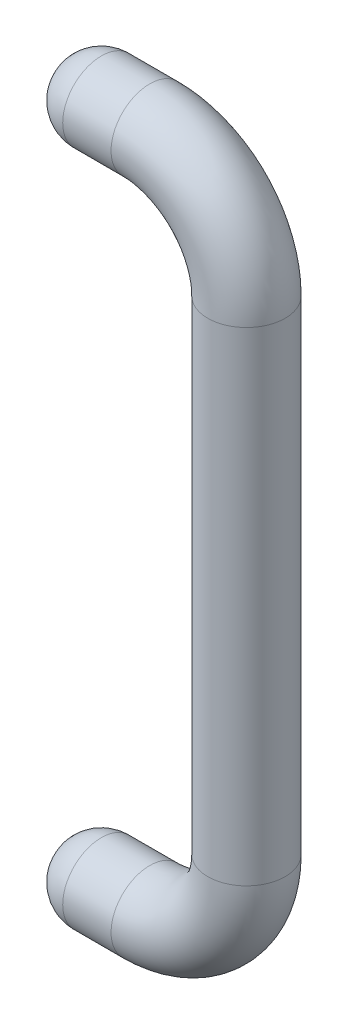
ISO-10303-21;
HEADER;
FILE_DESCRIPTION(('STEP AP214'),'2;1');
FILE_NAME('part.step','',(''),(''),'','','');
FILE_SCHEMA(('AUTOMOTIVE_DESIGN { 1 0 10303 214 1 1 1 1 }'));
ENDSEC;
DATA;
#1=APPLICATION_CONTEXT('core data for automotive mechanical design processes');
#2=APPLICATION_PROTOCOL_DEFINITION('international standard','automotive_design',2000,#1);
#3=PRODUCT_CONTEXT('',#1,'mechanical');
#4=PRODUCT('Part','Part','',(#3));
#5=PRODUCT_RELATED_PRODUCT_CATEGORY('part','',(#4));
#6=PRODUCT_DEFINITION_FORMATION('','',#4);
#7=PRODUCT_DEFINITION_CONTEXT('part definition',#1,'design');
#8=PRODUCT_DEFINITION('design','',#6,#7);
#9=PRODUCT_DEFINITION_SHAPE('','',#8);
#10=(LENGTH_UNIT() NAMED_UNIT(*) SI_UNIT(.MILLI.,.METRE.));
#11=(NAMED_UNIT(*) PLANE_ANGLE_UNIT() SI_UNIT($,.RADIAN.));
#12=(NAMED_UNIT(*) SI_UNIT($,.STERADIAN.) SOLID_ANGLE_UNIT());
#13=UNCERTAINTY_MEASURE_WITH_UNIT(LENGTH_MEASURE(1.E-05),#10,'distance_accuracy_value','');
#14=(GEOMETRIC_REPRESENTATION_CONTEXT(3) GLOBAL_UNCERTAINTY_ASSIGNED_CONTEXT((#13)) GLOBAL_UNIT_ASSIGNED_CONTEXT((#10,
#11,#12)) REPRESENTATION_CONTEXT('',''));
#15=CARTESIAN_POINT('',(0.,0.,0.));
#16=DIRECTION('',(0.,0.,1.));
#17=DIRECTION('',(1.,0.,0.));
#18=AXIS2_PLACEMENT_3D('',#15,#16,#17);
#19=CARTESIAN_POINT('',(-20.,15.,0.));
#20=DIRECTION('',(-1.,0.,0.));
#21=DIRECTION('',(0.,0.,-1.));
#22=AXIS2_PLACEMENT_3D('',#19,#20,#21);
#23=CYLINDRICAL_SURFACE('',#22,2.);
#24=CARTESIAN_POINT('',(-22.5,15.,0.));
#25=DIRECTION('',(1.,0.,0.));
#26=DIRECTION('',(0.,1.,0.));
#27=AXIS2_PLACEMENT_3D('',#24,#25,#26);
#28=CIRCLE('',#27,2.);
#29=CARTESIAN_POINT('',(-22.5,15.,-2.));
#30=VERTEX_POINT('',#29);
#31=CARTESIAN_POINT('',(-22.5,15.,2.));
#32=VERTEX_POINT('',#31);
#33=EDGE_CURVE('E37',#30,#32,#28,.T.);
#34=ORIENTED_EDGE('',*,*,#33,.T.);
#35=CARTESIAN_POINT('',(-22.5,15.,0.));
#36=DIRECTION('',(-1.,0.,0.));
#37=DIRECTION('',(0.,-1.,0.));
#38=AXIS2_PLACEMENT_3D('',#35,#36,#37);
#39=CIRCLE('',#38,2.);
#40=EDGE_CURVE('E46',#30,#32,#39,.T.);
#41=ORIENTED_EDGE('',*,*,#40,.F.);
#42=EDGE_LOOP('',(#34,#41));
#43=FACE_BOUND('',#42,.T.);
#44=CARTESIAN_POINT('',(-20.,15.,0.));
#45=DIRECTION('',(-1.,0.,0.));
#46=DIRECTION('',(0.,-1.,0.));
#47=AXIS2_PLACEMENT_3D('',#44,#45,#46);
#48=CIRCLE('',#47,2.);
#49=CARTESIAN_POINT('',(-20.,13.,0.));
#50=VERTEX_POINT('',#49);
#51=EDGE_CURVE('E11',#50,#50,#48,.T.);
#52=ORIENTED_EDGE('',*,*,#51,.T.);
#53=EDGE_LOOP('',(#52));
#54=FACE_BOUND('',#53,.T.);
#55=ADVANCED_FACE('F16',(#43,#54),#23,.T.);
#56=CARTESIAN_POINT('',(-20.,20.,0.));
#57=DIRECTION('',(0.,0.,-1.));
#58=DIRECTION('',(-1.,0.,0.));
#59=AXIS2_PLACEMENT_3D('',#56,#57,#58);
#60=TOROIDAL_SURFACE('',#59,5.,2.);
#61=CARTESIAN_POINT('',(-15.,20.,0.));
#62=DIRECTION('',(0.,-1.,0.));
#63=DIRECTION('',(-1.,0.,0.));
#64=AXIS2_PLACEMENT_3D('',#61,#62,#63);
#65=CIRCLE('',#64,2.);
#66=CARTESIAN_POINT('',(-13.,20.,0.));
#67=VERTEX_POINT('',#66);
#68=EDGE_CURVE('E24',#67,#67,#65,.T.);
#69=CARTESIAN_POINT('',(-20.,20.,0.));
#70=DIRECTION('',(0.,0.,-1.));
#71=DIRECTION('',(-1.,0.,0.));
#72=AXIS2_PLACEMENT_3D('',#69,#70,#71);
#73=CIRCLE('',#72,7.);
#74=EDGE_CURVE('',#67,#50,#73,.T.);
#75=ORIENTED_EDGE('',*,*,#68,.T.);
#76=ORIENTED_EDGE('',*,*,#51,.F.);
#77=ORIENTED_EDGE('',*,*,#74,.T.);
#78=ORIENTED_EDGE('',*,*,#74,.F.);
#79=EDGE_LOOP('',(#75,#77,#76,#78));
#80=FACE_BOUND('',#79,.T.);
#81=ADVANCED_FACE('F80',(#80),#60,.T.);
#82=CARTESIAN_POINT('',(-15.,45.,0.));
#83=DIRECTION('',(0.,-1.,0.));
#84=DIRECTION('',(0.,0.,-1.));
#85=AXIS2_PLACEMENT_3D('',#82,#83,#84);
#86=CYLINDRICAL_SURFACE('',#85,2.);
#87=ORIENTED_EDGE('',*,*,#68,.F.);
#88=EDGE_LOOP('',(#87));
#89=FACE_BOUND('',#88,.T.);
#90=CARTESIAN_POINT('',(-15.,45.,0.));
#91=DIRECTION('',(0.,-1.,0.));
#92=DIRECTION('',(-1.,0.,0.));
#93=AXIS2_PLACEMENT_3D('',#90,#91,#92);
#94=CIRCLE('',#93,2.);
#95=CARTESIAN_POINT('',(-13.,45.,0.));
#96=VERTEX_POINT('',#95);
#97=EDGE_CURVE('E67',#96,#96,#94,.T.);
#98=ORIENTED_EDGE('',*,*,#97,.T.);
#99=EDGE_LOOP('',(#98));
#100=FACE_BOUND('',#99,.T.);
#101=ADVANCED_FACE('F82',(#89,#100),#86,.T.);
#102=CARTESIAN_POINT('',(-20.,45.,0.));
#103=DIRECTION('',(0.,0.,-1.));
#104=DIRECTION('',(-1.,0.,0.));
#105=AXIS2_PLACEMENT_3D('',#102,#103,#104);
#106=TOROIDAL_SURFACE('',#105,5.,2.);
#107=CARTESIAN_POINT('',(-20.,50.,0.));
#108=DIRECTION('',(1.,0.,0.));
#109=DIRECTION('',(0.,-1.,0.));
#110=AXIS2_PLACEMENT_3D('',#107,#108,#109);
#111=CIRCLE('',#110,2.);
#112=CARTESIAN_POINT('',(-20.,52.,0.));
#113=VERTEX_POINT('',#112);
#114=EDGE_CURVE('E63',#113,#113,#111,.T.);
#115=CARTESIAN_POINT('',(-20.,45.,0.));
#116=DIRECTION('',(0.,0.,-1.));
#117=DIRECTION('',(-1.,0.,0.));
#118=AXIS2_PLACEMENT_3D('',#115,#116,#117);
#119=CIRCLE('',#118,7.);
#120=EDGE_CURVE('',#113,#96,#119,.T.);
#121=ORIENTED_EDGE('',*,*,#114,.T.);
#122=ORIENTED_EDGE('',*,*,#97,.F.);
#123=ORIENTED_EDGE('',*,*,#120,.T.);
#124=ORIENTED_EDGE('',*,*,#120,.F.);
#125=EDGE_LOOP('',(#121,#123,#122,#124));
#126=FACE_BOUND('',#125,.T.);
#127=ADVANCED_FACE('F85',(#126),#106,.T.);
#128=CARTESIAN_POINT('',(-22.5,50.,0.));
#129=DIRECTION('',(1.,0.,0.));
#130=DIRECTION('',(0.,0.,-1.));
#131=AXIS2_PLACEMENT_3D('',#128,#129,#130);
#132=CYLINDRICAL_SURFACE('',#131,2.);
#133=ORIENTED_EDGE('',*,*,#114,.F.);
#134=EDGE_LOOP('',(#133));
#135=FACE_BOUND('',#134,.T.);
#136=CARTESIAN_POINT('',(-22.5,50.,0.));
#137=DIRECTION('',(1.,0.,0.));
#138=DIRECTION('',(0.,1.,0.));
#139=AXIS2_PLACEMENT_3D('',#136,#137,#138);
#140=CIRCLE('',#139,2.);
#141=CARTESIAN_POINT('',(-22.5,50.,-2.));
#142=VERTEX_POINT('',#141);
#143=CARTESIAN_POINT('',(-22.5,50.,2.));
#144=VERTEX_POINT('',#143);
#145=EDGE_CURVE('E42',#142,#144,#140,.T.);
#146=ORIENTED_EDGE('',*,*,#145,.T.);
#147=CARTESIAN_POINT('',(-22.5,50.,0.));
#148=DIRECTION('',(-1.,0.,0.));
#149=DIRECTION('',(0.,-1.,0.));
#150=AXIS2_PLACEMENT_3D('',#147,#148,#149);
#151=CIRCLE('',#150,2.);
#152=EDGE_CURVE('E30',#142,#144,#151,.T.);
#153=ORIENTED_EDGE('',*,*,#152,.F.);
#154=EDGE_LOOP('',(#146,#153));
#155=FACE_BOUND('',#154,.T.);
#156=ADVANCED_FACE('F48',(#135,#155),#132,.T.);
#157=CARTESIAN_POINT('',(-22.5,15.,0.));
#158=DIRECTION('',(0.,0.,1.));
#159=DIRECTION('',(0.,1.,0.));
#160=AXIS2_PLACEMENT_3D('',#157,#158,#159);
#161=SPHERICAL_SURFACE('',#160,2.);
#162=CARTESIAN_POINT('',(-22.5,15.,0.));
#163=DIRECTION('',(1.,0.,0.));
#164=DIRECTION('',(0.,1.,0.));
#165=AXIS2_PLACEMENT_3D('',#162,#163,#164);
#166=SPHERICAL_SURFACE('',#165,2.);
#167=ORIENTED_EDGE('',*,*,#33,.F.);
#168=ORIENTED_EDGE('',*,*,#40,.T.);
#169=EDGE_LOOP('',(#167,#168));
#170=FACE_BOUND('',#169,.T.);
#171=ADVANCED_FACE('F95',(#170),#166,.T.);
#172=CARTESIAN_POINT('',(-22.5,50.,0.));
#173=DIRECTION('',(0.,0.,1.));
#174=DIRECTION('',(0.,1.,0.));
#175=AXIS2_PLACEMENT_3D('',#172,#173,#174);
#176=SPHERICAL_SURFACE('',#175,2.);
#177=CARTESIAN_POINT('',(-22.5,50.,0.));
#178=DIRECTION('',(1.,0.,0.));
#179=DIRECTION('',(0.,1.,0.));
#180=AXIS2_PLACEMENT_3D('',#177,#178,#179);
#181=SPHERICAL_SURFACE('',#180,2.);
#182=ORIENTED_EDGE('',*,*,#145,.F.);
#183=ORIENTED_EDGE('',*,*,#152,.T.);
#184=EDGE_LOOP('',(#182,#183));
#185=FACE_BOUND('',#184,.T.);
#186=ADVANCED_FACE('F43',(#185),#181,.T.);
#187=CLOSED_SHELL('',(#55,#81,#101,#127,#156,#171,#186));
#188=MANIFOLD_SOLID_BREP('B1',#187);
#189=ADVANCED_BREP_SHAPE_REPRESENTATION('',(#18,#188),#14);
#190=SHAPE_DEFINITION_REPRESENTATION(#9,#189);
ENDSEC;
END-ISO-10303-21;
